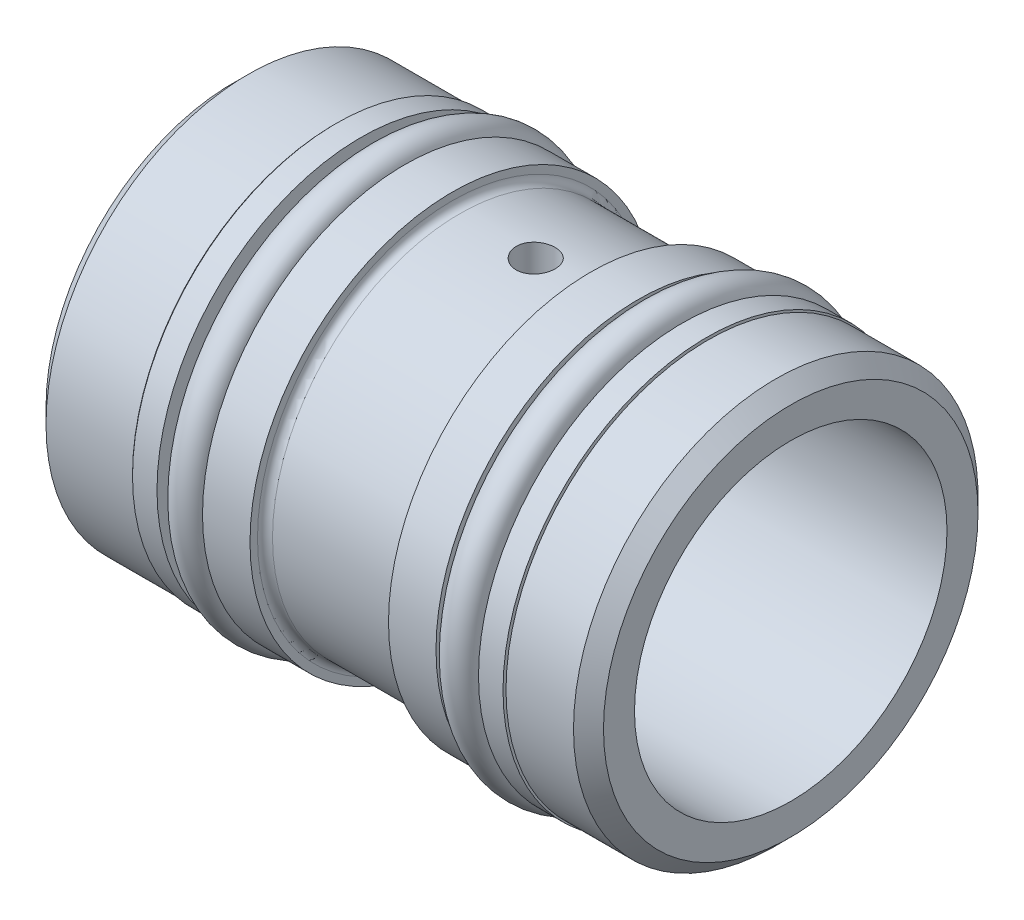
ISO-10303-21;
HEADER;
FILE_DESCRIPTION(('STEP AP214'),'2;1');
FILE_NAME('part.step','',(''),(''),'','','');
FILE_SCHEMA(('AUTOMOTIVE_DESIGN { 1 0 10303 214 1 1 1 1 }'));
ENDSEC;
DATA;
#1=APPLICATION_CONTEXT('core data for automotive mechanical design processes');
#2=APPLICATION_PROTOCOL_DEFINITION('international standard','automotive_design',2000,#1);
#3=PRODUCT_CONTEXT('',#1,'mechanical');
#4=PRODUCT('Part','Part','',(#3));
#5=PRODUCT_RELATED_PRODUCT_CATEGORY('part','',(#4));
#6=PRODUCT_DEFINITION_FORMATION('','',#4);
#7=PRODUCT_DEFINITION_CONTEXT('part definition',#1,'design');
#8=PRODUCT_DEFINITION('design','',#6,#7);
#9=PRODUCT_DEFINITION_SHAPE('','',#8);
#10=(LENGTH_UNIT() NAMED_UNIT(*) SI_UNIT(.MILLI.,.METRE.));
#11=(NAMED_UNIT(*) PLANE_ANGLE_UNIT() SI_UNIT($,.RADIAN.));
#12=(NAMED_UNIT(*) SI_UNIT($,.STERADIAN.) SOLID_ANGLE_UNIT());
#13=UNCERTAINTY_MEASURE_WITH_UNIT(LENGTH_MEASURE(1.E-05),#10,'distance_accuracy_value','');
#14=(GEOMETRIC_REPRESENTATION_CONTEXT(3) GLOBAL_UNCERTAINTY_ASSIGNED_CONTEXT((#13)) GLOBAL_UNIT_ASSIGNED_CONTEXT((#10,
#11,#12)) REPRESENTATION_CONTEXT('',''));
#15=CARTESIAN_POINT('',(0.,0.,0.));
#16=DIRECTION('',(0.,0.,1.));
#17=DIRECTION('',(1.,0.,0.));
#18=AXIS2_PLACEMENT_3D('',#15,#16,#17);
#19=CARTESIAN_POINT('',(0.,0.,0.));
#20=DIRECTION('',(-1.,0.,0.));
#21=DIRECTION('',(0.,0.,1.));
#22=AXIS2_PLACEMENT_3D('',#19,#20,#21);
#23=CYLINDRICAL_SURFACE('',#22,9.0043);
#24=CARTESIAN_POINT('',(7.73880715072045,0.,0.));
#25=DIRECTION('',(-1.,0.,0.));
#26=DIRECTION('',(0.,0.,1.));
#27=AXIS2_PLACEMENT_3D('',#24,#25,#26);
#28=CIRCLE('',#27,9.0043);
#29=CARTESIAN_POINT('',(7.73880715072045,0.,9.0043));
#30=VERTEX_POINT('',#29);
#31=EDGE_CURVE('E147',#30,#30,#28,.T.);
#32=ORIENTED_EDGE('',*,*,#31,.F.);
#33=EDGE_LOOP('',(#32));
#34=FACE_BOUND('',#33,.T.);
#35=CARTESIAN_POINT('',(8.6487,0.,0.));
#36=DIRECTION('',(1.,0.,0.));
#37=DIRECTION('',(0.,0.,-1.));
#38=AXIS2_PLACEMENT_3D('',#35,#36,#37);
#39=CIRCLE('',#38,9.0043);
#40=CARTESIAN_POINT('',(8.6487,0.,-9.0043));
#41=VERTEX_POINT('',#40);
#42=EDGE_CURVE('E10',#41,#41,#39,.T.);
#43=ORIENTED_EDGE('',*,*,#42,.F.);
#44=EDGE_LOOP('',(#43));
#45=FACE_BOUND('',#44,.T.);
#46=ADVANCED_FACE('F32',(#34,#45),#23,.T.);
#47=CARTESIAN_POINT('',(9.9695,0.,0.));
#48=DIRECTION('',(-1.,0.,0.));
#49=DIRECTION('',(0.,0.,1.));
#50=AXIS2_PLACEMENT_3D('',#47,#48,#49);
#51=CIRCLE('',#50,9.0043);
#52=CARTESIAN_POINT('',(9.9695,0.,9.0043));
#53=VERTEX_POINT('',#52);
#54=EDGE_CURVE('E199',#53,#53,#51,.T.);
#55=ORIENTED_EDGE('',*,*,#54,.T.);
#56=EDGE_LOOP('',(#55));
#57=FACE_BOUND('',#56,.T.);
#58=CARTESIAN_POINT('',(9.8933,0.,0.));
#59=DIRECTION('',(-1.,0.,0.));
#60=DIRECTION('',(0.,0.,1.));
#61=AXIS2_PLACEMENT_3D('',#58,#59,#60);
#62=CIRCLE('',#61,9.0043);
#63=CARTESIAN_POINT('',(9.8933,0.,9.0043));
#64=VERTEX_POINT('',#63);
#65=EDGE_CURVE('E44',#64,#64,#62,.T.);
#66=ORIENTED_EDGE('',*,*,#65,.F.);
#67=EDGE_LOOP('',(#66));
#68=FACE_BOUND('',#67,.T.);
#69=ADVANCED_FACE('F119',(#57,#68),#23,.T.);
#70=CARTESIAN_POINT('',(6.4135,0.,0.));
#71=DIRECTION('',(-1.,0.,0.));
#72=DIRECTION('',(0.,0.,1.));
#73=AXIS2_PLACEMENT_3D('',#70,#71,#72);
#74=CIRCLE('',#73,9.0043);
#75=CARTESIAN_POINT('',(6.4135,0.,9.0043));
#76=VERTEX_POINT('',#75);
#77=EDGE_CURVE('E143',#76,#76,#74,.T.);
#78=ORIENTED_EDGE('',*,*,#77,.F.);
#79=EDGE_LOOP('',(#78));
#80=FACE_BOUND('',#79,.T.);
#81=CARTESIAN_POINT('',(7.01859284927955,0.,0.));
#82=DIRECTION('',(1.,0.,0.));
#83=DIRECTION('',(0.,0.,-1.));
#84=AXIS2_PLACEMENT_3D('',#81,#82,#83);
#85=CIRCLE('',#84,9.0043);
#86=CARTESIAN_POINT('',(7.01859284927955,0.,-9.0043));
#87=VERTEX_POINT('',#86);
#88=EDGE_CURVE('E49',#87,#87,#85,.T.);
#89=ORIENTED_EDGE('',*,*,#88,.F.);
#90=EDGE_LOOP('',(#89));
#91=FACE_BOUND('',#90,.T.);
#92=ADVANCED_FACE('F122',(#80,#91),#23,.T.);
#93=CARTESIAN_POINT('',(0.,0.,0.));
#94=DIRECTION('',(-1.,0.,0.));
#95=DIRECTION('',(0.,0.,1.));
#96=AXIS2_PLACEMENT_3D('',#93,#94,#95);
#97=CYLINDRICAL_SURFACE('',#96,9.0043);
#98=CARTESIAN_POINT('',(-7.6835,0.,0.));
#99=DIRECTION('',(-1.,0.,0.));
#100=DIRECTION('',(0.,0.,1.));
#101=AXIS2_PLACEMENT_3D('',#98,#99,#100);
#102=CIRCLE('',#101,9.0043);
#103=CARTESIAN_POINT('',(-7.6835,0.,9.0043));
#104=VERTEX_POINT('',#103);
#105=EDGE_CURVE('E160',#104,#104,#102,.T.);
#106=ORIENTED_EDGE('',*,*,#105,.F.);
#107=EDGE_LOOP('',(#106));
#108=FACE_BOUND('',#107,.T.);
#109=CARTESIAN_POINT('',(-6.77360715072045,0.,0.));
#110=DIRECTION('',(1.,0.,0.));
#111=DIRECTION('',(0.,0.,-1.));
#112=AXIS2_PLACEMENT_3D('',#109,#110,#111);
#113=CIRCLE('',#112,9.0043);
#114=CARTESIAN_POINT('',(-6.77360715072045,0.,-9.0043));
#115=VERTEX_POINT('',#114);
#116=EDGE_CURVE('E149',#115,#115,#113,.T.);
#117=ORIENTED_EDGE('',*,*,#116,.F.);
#118=EDGE_LOOP('',(#117));
#119=FACE_BOUND('',#118,.T.);
#120=ADVANCED_FACE('F132',(#108,#119),#97,.T.);
#121=CARTESIAN_POINT('',(-5.4483,0.,0.));
#122=DIRECTION('',(-1.,0.,0.));
#123=DIRECTION('',(0.,0.,1.));
#124=AXIS2_PLACEMENT_3D('',#121,#122,#123);
#125=CIRCLE('',#124,9.0043);
#126=CARTESIAN_POINT('',(-5.4483,0.,9.0043));
#127=VERTEX_POINT('',#126);
#128=EDGE_CURVE('E215',#127,#127,#125,.T.);
#129=ORIENTED_EDGE('',*,*,#128,.T.);
#130=EDGE_LOOP('',(#129));
#131=FACE_BOUND('',#130,.T.);
#132=CARTESIAN_POINT('',(-6.05339284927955,0.,0.));
#133=DIRECTION('',(-1.,0.,0.));
#134=DIRECTION('',(0.,0.,1.));
#135=AXIS2_PLACEMENT_3D('',#132,#133,#134);
#136=CIRCLE('',#135,9.0043);
#137=CARTESIAN_POINT('',(-6.05339284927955,0.,9.0043));
#138=VERTEX_POINT('',#137);
#139=EDGE_CURVE('E154',#138,#138,#136,.T.);
#140=ORIENTED_EDGE('',*,*,#139,.F.);
#141=EDGE_LOOP('',(#140));
#142=FACE_BOUND('',#141,.T.);
#143=ADVANCED_FACE('F137',(#131,#142),#97,.T.);
#144=CARTESIAN_POINT('',(-9.0043,0.,0.));
#145=DIRECTION('',(-1.,0.,0.));
#146=DIRECTION('',(0.,0.,1.));
#147=AXIS2_PLACEMENT_3D('',#144,#145,#146);
#148=CIRCLE('',#147,9.0043);
#149=CARTESIAN_POINT('',(-9.0043,0.,9.0043));
#150=VERTEX_POINT('',#149);
#151=EDGE_CURVE('E218',#150,#150,#148,.T.);
#152=ORIENTED_EDGE('',*,*,#151,.F.);
#153=EDGE_LOOP('',(#152));
#154=FACE_BOUND('',#153,.T.);
#155=CARTESIAN_POINT('',(-8.9281,0.,0.));
#156=DIRECTION('',(1.,0.,0.));
#157=DIRECTION('',(0.,0.,-1.));
#158=AXIS2_PLACEMENT_3D('',#155,#156,#157);
#159=CIRCLE('',#158,9.0043);
#160=CARTESIAN_POINT('',(-8.9281,0.,-9.0043));
#161=VERTEX_POINT('',#160);
#162=EDGE_CURVE('E157',#161,#161,#159,.T.);
#163=ORIENTED_EDGE('',*,*,#162,.F.);
#164=EDGE_LOOP('',(#163));
#165=FACE_BOUND('',#164,.T.);
#166=ADVANCED_FACE('F98',(#154,#165),#97,.T.);
#167=CARTESIAN_POINT('',(0.,0.,0.));
#168=DIRECTION('',(-1.,0.,0.));
#169=DIRECTION('',(0.,0.,1.));
#170=AXIS2_PLACEMENT_3D('',#167,#168,#169);
#171=CYLINDRICAL_SURFACE('',#170,4.7625);
#172=CARTESIAN_POINT('',(0.0888999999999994,0.,0.));
#173=DIRECTION('',(-1.,0.,0.));
#174=DIRECTION('',(0.,0.,1.));
#175=AXIS2_PLACEMENT_3D('',#172,#173,#174);
#176=CIRCLE('',#175,4.7625);
#177=CARTESIAN_POINT('',(0.0888999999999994,0.,4.7625));
#178=VERTEX_POINT('',#177);
#179=EDGE_CURVE('E187',#178,#178,#176,.T.);
#180=ORIENTED_EDGE('',*,*,#179,.F.);
#181=EDGE_LOOP('',(#180));
#182=FACE_BOUND('',#181,.T.);
#183=CARTESIAN_POINT('',(-14.1605,0.,0.));
#184=DIRECTION('',(-1.,0.,0.));
#185=DIRECTION('',(0.,0.,1.));
#186=AXIS2_PLACEMENT_3D('',#183,#184,#185);
#187=CIRCLE('',#186,4.7625);
#188=CARTESIAN_POINT('',(-14.1605,0.,4.7625));
#189=VERTEX_POINT('',#188);
#190=EDGE_CURVE('E224',#189,#189,#187,.T.);
#191=ORIENTED_EDGE('',*,*,#190,.T.);
#192=EDGE_LOOP('',(#191));
#193=FACE_BOUND('',#192,.T.);
#194=ADVANCED_FACE('F94',(#182,#193),#171,.F.);
#195=CARTESIAN_POINT('',(0.0888999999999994,4.7625,0.));
#196=DIRECTION('',(-1.,0.,0.));
#197=DIRECTION('',(0.,0.,1.));
#198=AXIS2_PLACEMENT_3D('',#195,#196,#197);
#199=PLANE('',#198);
#200=CARTESIAN_POINT('',(0.0888999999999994,0.,0.));
#201=DIRECTION('',(-1.,0.,0.));
#202=DIRECTION('',(0.,0.,1.));
#203=AXIS2_PLACEMENT_3D('',#200,#201,#202);
#204=CIRCLE('',#203,7.9375);
#205=CARTESIAN_POINT('',(0.0888999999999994,0.,7.9375));
#206=VERTEX_POINT('',#205);
#207=EDGE_CURVE('E190',#206,#206,#204,.T.);
#208=ORIENTED_EDGE('',*,*,#207,.F.);
#209=EDGE_LOOP('',(#208));
#210=FACE_BOUND('',#209,.T.);
#211=ORIENTED_EDGE('',*,*,#179,.T.);
#212=EDGE_LOOP('',(#211));
#213=FACE_BOUND('',#212,.T.);
#214=ADVANCED_FACE('F88',(#210,#213),#199,.F.);
#215=CARTESIAN_POINT('',(0.,0.,0.));
#216=DIRECTION('',(-1.,0.,0.));
#217=DIRECTION('',(0.,0.,1.));
#218=AXIS2_PLACEMENT_3D('',#215,#216,#217);
#219=CYLINDRICAL_SURFACE('',#218,7.9375);
#220=CARTESIAN_POINT('',(1.2065,-7.8754439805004,0.9906));
#221=CARTESIAN_POINT('',(1.15109052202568,-7.87544477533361,0.990597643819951));
#222=CARTESIAN_POINT('',(1.09564639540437,-7.87603506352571,0.985935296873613));
#223=CARTESIAN_POINT('',(0.986301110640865,-7.87833154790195,0.967409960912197));
#224=CARTESIAN_POINT('',(0.932401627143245,-7.88003891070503,0.953537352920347));
#225=CARTESIAN_POINT('',(0.827744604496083,-7.88437321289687,0.917006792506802));
#226=CARTESIAN_POINT('',(0.776984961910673,-7.88699952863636,0.894354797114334));
#227=CARTESIAN_POINT('',(0.679996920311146,-7.892875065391,0.840921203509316));
#228=CARTESIAN_POINT('',(0.633767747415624,-7.89612417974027,0.810140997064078));
#229=CARTESIAN_POINT('',(0.546885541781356,-7.9028995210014,0.741140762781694));
#230=CARTESIAN_POINT('',(0.506261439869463,-7.90642704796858,0.702884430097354));
#231=CARTESIAN_POINT('',(0.431992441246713,-7.9133500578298,0.620096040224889));
#232=CARTESIAN_POINT('',(0.398347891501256,-7.91674553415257,0.575563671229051));
#233=CARTESIAN_POINT('',(0.338889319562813,-7.92303516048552,0.481305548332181));
#234=CARTESIAN_POINT('',(0.313101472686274,-7.92592762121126,0.431563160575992));
#235=CARTESIAN_POINT('',(0.270255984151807,-7.93087102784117,0.32841157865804));
#236=CARTESIAN_POINT('',(0.253198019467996,-7.93292200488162,0.275002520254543));
#237=CARTESIAN_POINT('',(0.22838292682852,-7.93594219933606,0.166329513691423));
#238=CARTESIAN_POINT('',(0.220577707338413,-7.93691700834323,0.111076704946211));
#239=CARTESIAN_POINT('',(0.214340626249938,-7.93769412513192,3.74751752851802E-05));
#240=CARTESIAN_POINT('',(0.215908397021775,-7.93749647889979,-0.0557489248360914));
#241=CARTESIAN_POINT('',(0.228334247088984,-7.93595547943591,-0.165944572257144));
#242=CARTESIAN_POINT('',(0.239140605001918,-7.9346185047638,-0.22035975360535));
#243=CARTESIAN_POINT('',(0.269656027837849,-7.93095624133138,-0.326598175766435));
#244=CARTESIAN_POINT('',(0.289365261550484,-7.92863093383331,-0.378421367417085));
#245=CARTESIAN_POINT('',(0.337181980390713,-7.9232423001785,-0.478164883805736));
#246=CARTESIAN_POINT('',(0.365311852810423,-7.9201770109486,-0.526074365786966));
#247=CARTESIAN_POINT('',(0.429155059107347,-7.9136513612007,-0.616512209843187));
#248=CARTESIAN_POINT('',(0.464868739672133,-7.91019098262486,-0.659040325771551));
#249=CARTESIAN_POINT('',(0.543155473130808,-7.9032345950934,-0.737812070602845));
#250=CARTESIAN_POINT('',(0.585773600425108,-7.89973850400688,-0.77401091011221));
#251=CARTESIAN_POINT('',(0.676504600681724,-7.89312799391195,-0.838748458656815));
#252=CARTESIAN_POINT('',(0.724617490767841,-7.89001357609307,-0.86728714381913));
#253=CARTESIAN_POINT('',(0.825012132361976,-7.88451906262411,-0.915896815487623));
#254=CARTESIAN_POINT('',(0.877295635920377,-7.88213927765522,-0.935964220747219));
#255=CARTESIAN_POINT('',(0.984526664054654,-7.87838953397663,-0.96702200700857));
#256=CARTESIAN_POINT('',(1.03947406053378,-7.87701952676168,-0.97801282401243));
#257=CARTESIAN_POINT('',(1.15007756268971,-7.87545331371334,-0.990546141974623));
#258=CARTESIAN_POINT('',(1.20572641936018,-7.87524927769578,-0.992151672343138));
#259=CARTESIAN_POINT('',(1.3164998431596,-7.8760173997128,-0.986035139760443));
#260=CARTESIAN_POINT('',(1.37162442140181,-7.8769895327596,-0.978313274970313));
#261=CARTESIAN_POINT('',(1.47959566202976,-7.87999331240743,-0.953814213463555));
#262=CARTESIAN_POINT('',(1.53244935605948,-7.88202138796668,-0.937067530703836));
#263=CARTESIAN_POINT('',(1.63459847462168,-7.88690564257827,-0.895025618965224));
#264=CARTESIAN_POINT('',(1.68389377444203,-7.88976185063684,-0.869730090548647));
#265=CARTESIAN_POINT('',(1.77781197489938,-7.89599930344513,-0.811153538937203));
#266=CARTESIAN_POINT('',(1.82240891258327,-7.89938323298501,-0.777831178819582));
#267=CARTESIAN_POINT('',(1.90539955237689,-7.90628640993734,-0.704205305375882));
#268=CARTESIAN_POINT('',(1.94379301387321,-7.909805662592,-0.663901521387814));
#269=CARTESIAN_POINT('',(2.01350822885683,-7.91660700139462,-0.577181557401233));
#270=CARTESIAN_POINT('',(2.04478856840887,-7.91988762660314,-0.53073195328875));
#271=CARTESIAN_POINT('',(2.0991030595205,-7.92582022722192,-0.433201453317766));
#272=CARTESIAN_POINT('',(2.12213737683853,-7.92847221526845,-0.382120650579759));
#273=CARTESIAN_POINT('',(2.1592375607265,-7.93284224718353,-0.276915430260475));
#274=CARTESIAN_POINT('',(2.17332737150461,-7.93456278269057,-0.222799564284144));
#275=CARTESIAN_POINT('',(2.19221647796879,-7.93688639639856,-0.112947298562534));
#276=CARTESIAN_POINT('',(2.19701619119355,-7.93748952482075,-0.0572109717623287));
#277=CARTESIAN_POINT('',(2.1971810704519,-7.93751013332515,0.0538956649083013));
#278=CARTESIAN_POINT('',(2.19261009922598,-7.93693563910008,0.109265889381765));
#279=CARTESIAN_POINT('',(2.17429860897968,-7.9346815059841,0.218444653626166));
#280=CARTESIAN_POINT('',(2.16055809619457,-7.93300186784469,0.272253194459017));
#281=CARTESIAN_POINT('',(2.12431759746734,-7.92872534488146,0.37677286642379));
#282=CARTESIAN_POINT('',(2.10182065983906,-7.92612877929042,0.427485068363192));
#283=CARTESIAN_POINT('',(2.04871253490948,-7.92030593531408,0.524424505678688));
#284=CARTESIAN_POINT('',(2.01810125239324,-7.91707964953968,0.570651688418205));
#285=CARTESIAN_POINT('',(1.94939707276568,-7.91033127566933,0.657635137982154));
#286=CARTESIAN_POINT('',(1.91125665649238,-7.90680739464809,0.69835373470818));
#287=CARTESIAN_POINT('',(1.82867551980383,-7.89987538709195,0.772837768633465));
#288=CARTESIAN_POINT('',(1.78423330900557,-7.89646728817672,0.806601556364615));
#289=CARTESIAN_POINT('',(1.69011401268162,-7.89013873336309,0.866328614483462));
#290=CARTESIAN_POINT('',(1.64041743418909,-7.88722020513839,0.892261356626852));
#291=CARTESIAN_POINT('',(1.53736614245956,-7.88222383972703,0.935376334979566));
#292=CARTESIAN_POINT('',(1.48401548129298,-7.88014508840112,0.95256809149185));
#293=CARTESIAN_POINT('',(1.39307375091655,-7.87756854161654,0.973595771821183));
#294=CARTESIAN_POINT('',(1.35605637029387,-7.87677579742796,0.979963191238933));
#295=CARTESIAN_POINT('',(1.2815312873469,-7.87571324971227,0.988466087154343));
#296=CARTESIAN_POINT('',(1.24402358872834,-7.87544344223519,0.990601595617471));
#297=CARTESIAN_POINT('',(1.2065,-7.8754439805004,0.9906));
#298=B_SPLINE_CURVE_WITH_KNOTS('',3,(#220,#221,#222,#223,#224,#225,#226,#227,#228,#229,#230,
#231,#232,#233,#234,#235,#236,#237,#238,#239,#240,#241,#242,#243,#244,#245,#246,#247,#248,#249,
#250,#251,#252,#253,#254,#255,#256,#257,#258,#259,#260,#261,#262,#263,#264,#265,#266,#267,#268,
#269,#270,#271,#272,#273,#274,#275,#276,#277,#278,#279,#280,#281,#282,#283,#284,#285,#286,#287,
#288,#289,#290,#291,#292,#293,#294,#295,#296,#297),.UNSPECIFIED.,.T.,.F.,(4,2,2,2,2,2,2,2,2,2,2,
2,2,2,2,2,2,2,2,2,2,2,2,2,2,2,2,2,2,2,2,2,2,2,2,2,2,2,4),(0.,0.166091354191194,
0.332356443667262,0.498508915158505,0.664632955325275,0.831584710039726,0.998544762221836,
1.16605512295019,1.33355928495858,1.50018896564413,1.66681211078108,1.83250849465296,
1.99820802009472,2.16435205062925,2.33050367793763,2.49778727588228,2.66507139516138,
2.83242616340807,2.9997728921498,3.16599445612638,3.3322124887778,3.49787201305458,
3.66353734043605,3.83007477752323,3.99661867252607,4.16410871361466,4.33159538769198,
4.49863179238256,4.66566068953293,4.83155504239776,4.99744928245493,5.16328582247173,
5.32912430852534,5.49604500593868,5.66300524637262,5.83060819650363,5.99802820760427,
6.11050699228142,6.22298492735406),.UNSPECIFIED.);
#299=CARTESIAN_POINT('',(1.2065,-7.8754439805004,0.9906));
#300=VERTEX_POINT('',#299);
#301=EDGE_CURVE('E78',#300,#300,#298,.T.);
#302=ORIENTED_EDGE('',*,*,#301,.T.);
#303=EDGE_LOOP('',(#302));
#304=FACE_BOUND('',#303,.T.);
#305=CARTESIAN_POINT('',(1.2065,7.8754439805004,0.9906));
#306=CARTESIAN_POINT('',(1.26190947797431,7.87544477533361,0.990597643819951));
#307=CARTESIAN_POINT('',(1.31735360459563,7.87603506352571,0.985935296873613));
#308=CARTESIAN_POINT('',(1.42669888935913,7.87833154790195,0.967409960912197));
#309=CARTESIAN_POINT('',(1.48059837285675,7.88003891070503,0.953537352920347));
#310=CARTESIAN_POINT('',(1.58525539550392,7.88437321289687,0.917006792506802));
#311=CARTESIAN_POINT('',(1.63601503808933,7.88699952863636,0.894354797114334));
#312=CARTESIAN_POINT('',(1.73300307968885,7.892875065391,0.840921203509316));
#313=CARTESIAN_POINT('',(1.77923225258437,7.89612417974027,0.810140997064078));
#314=CARTESIAN_POINT('',(1.86611445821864,7.9028995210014,0.741140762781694));
#315=CARTESIAN_POINT('',(1.90673856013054,7.90642704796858,0.702884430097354));
#316=CARTESIAN_POINT('',(1.98100755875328,7.9133500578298,0.620096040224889));
#317=CARTESIAN_POINT('',(2.01465210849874,7.91674553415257,0.575563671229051));
#318=CARTESIAN_POINT('',(2.07411068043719,7.92303516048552,0.481305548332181));
#319=CARTESIAN_POINT('',(2.09989852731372,7.92592762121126,0.431563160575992));
#320=CARTESIAN_POINT('',(2.14274401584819,7.93087102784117,0.32841157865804));
#321=CARTESIAN_POINT('',(2.159801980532,7.93292200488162,0.275002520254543));
#322=CARTESIAN_POINT('',(2.18461707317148,7.93594219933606,0.166329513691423));
#323=CARTESIAN_POINT('',(2.19242229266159,7.93691700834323,0.111076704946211));
#324=CARTESIAN_POINT('',(2.19865937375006,7.93769412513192,3.74751752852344E-05));
#325=CARTESIAN_POINT('',(2.19709160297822,7.93749647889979,-0.0557489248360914));
#326=CARTESIAN_POINT('',(2.18466575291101,7.93595547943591,-0.165944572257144));
#327=CARTESIAN_POINT('',(2.17385939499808,7.9346185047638,-0.22035975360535));
#328=CARTESIAN_POINT('',(2.14334397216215,7.93095624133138,-0.326598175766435));
#329=CARTESIAN_POINT('',(2.12363473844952,7.92863093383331,-0.378421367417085));
#330=CARTESIAN_POINT('',(2.07581801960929,7.9232423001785,-0.478164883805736));
#331=CARTESIAN_POINT('',(2.04768814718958,7.9201770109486,-0.526074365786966));
#332=CARTESIAN_POINT('',(1.98384494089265,7.9136513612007,-0.616512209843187));
#333=CARTESIAN_POINT('',(1.94813126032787,7.91019098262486,-0.659040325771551));
#334=CARTESIAN_POINT('',(1.86984452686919,7.9032345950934,-0.737812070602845));
#335=CARTESIAN_POINT('',(1.82722639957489,7.89973850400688,-0.77401091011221));
#336=CARTESIAN_POINT('',(1.73649539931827,7.89312799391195,-0.838748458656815));
#337=CARTESIAN_POINT('',(1.68838250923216,7.89001357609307,-0.86728714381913));
#338=CARTESIAN_POINT('',(1.58798786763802,7.88451906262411,-0.915896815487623));
#339=CARTESIAN_POINT('',(1.53570436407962,7.88213927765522,-0.935964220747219));
#340=CARTESIAN_POINT('',(1.42847333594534,7.87838953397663,-0.96702200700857));
#341=CARTESIAN_POINT('',(1.37352593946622,7.87701952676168,-0.97801282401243));
#342=CARTESIAN_POINT('',(1.26292243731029,7.87545331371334,-0.990546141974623));
#343=CARTESIAN_POINT('',(1.20727358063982,7.87524927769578,-0.992151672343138));
#344=CARTESIAN_POINT('',(1.0965001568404,7.8760173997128,-0.986035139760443));
#345=CARTESIAN_POINT('',(1.04137557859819,7.8769895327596,-0.978313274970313));
#346=CARTESIAN_POINT('',(0.933404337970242,7.87999331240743,-0.953814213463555));
#347=CARTESIAN_POINT('',(0.880550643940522,7.88202138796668,-0.937067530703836));
#348=CARTESIAN_POINT('',(0.778401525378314,7.88690564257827,-0.895025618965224));
#349=CARTESIAN_POINT('',(0.729106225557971,7.88976185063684,-0.869730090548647));
#350=CARTESIAN_POINT('',(0.635188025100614,7.89599930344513,-0.811153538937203));
#351=CARTESIAN_POINT('',(0.590591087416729,7.89938323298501,-0.777831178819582));
#352=CARTESIAN_POINT('',(0.507600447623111,7.90628640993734,-0.704205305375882));
#353=CARTESIAN_POINT('',(0.469206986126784,7.909805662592,-0.663901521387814));
#354=CARTESIAN_POINT('',(0.39949177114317,7.91660700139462,-0.577181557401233));
#355=CARTESIAN_POINT('',(0.368211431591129,7.91988762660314,-0.530731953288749));
#356=CARTESIAN_POINT('',(0.313896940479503,7.92582022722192,-0.433201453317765));
#357=CARTESIAN_POINT('',(0.290862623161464,7.92847221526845,-0.382120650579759));
#358=CARTESIAN_POINT('',(0.253762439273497,7.93284224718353,-0.276915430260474));
#359=CARTESIAN_POINT('',(0.239672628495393,7.93456278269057,-0.222799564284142));
#360=CARTESIAN_POINT('',(0.220783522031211,7.93688639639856,-0.112947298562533));
#361=CARTESIAN_POINT('',(0.215983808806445,7.93748952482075,-0.0572109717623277));
#362=CARTESIAN_POINT('',(0.215818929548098,7.93751013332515,0.0538956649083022));
#363=CARTESIAN_POINT('',(0.220389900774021,7.93693563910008,0.109265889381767));
#364=CARTESIAN_POINT('',(0.238701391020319,7.9346815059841,0.218444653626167));
#365=CARTESIAN_POINT('',(0.252441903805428,7.93300186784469,0.272253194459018));
#366=CARTESIAN_POINT('',(0.288682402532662,7.92872534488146,0.376772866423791));
#367=CARTESIAN_POINT('',(0.311179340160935,7.92612877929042,0.427485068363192));
#368=CARTESIAN_POINT('',(0.364287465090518,7.92030593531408,0.524424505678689));
#369=CARTESIAN_POINT('',(0.39489874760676,7.91707964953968,0.570651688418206));
#370=CARTESIAN_POINT('',(0.463602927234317,7.91033127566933,0.657635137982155));
#371=CARTESIAN_POINT('',(0.501743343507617,7.90680739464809,0.698353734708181));
#372=CARTESIAN_POINT('',(0.584324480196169,7.89987538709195,0.772837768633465));
#373=CARTESIAN_POINT('',(0.62876669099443,7.89646728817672,0.806601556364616));
#374=CARTESIAN_POINT('',(0.722885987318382,7.89013873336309,0.866328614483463));
#375=CARTESIAN_POINT('',(0.77258256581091,7.88722020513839,0.892261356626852));
#376=CARTESIAN_POINT('',(0.875633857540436,7.88222383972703,0.935376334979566));
#377=CARTESIAN_POINT('',(0.928984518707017,7.88014508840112,0.95256809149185));
#378=CARTESIAN_POINT('',(1.01992624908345,7.87756854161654,0.973595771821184));
#379=CARTESIAN_POINT('',(1.05694362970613,7.87677579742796,0.979963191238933));
#380=CARTESIAN_POINT('',(1.1314687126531,7.87571324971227,0.988466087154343));
#381=CARTESIAN_POINT('',(1.16897641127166,7.87544344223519,0.990601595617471));
#382=CARTESIAN_POINT('',(1.2065,7.8754439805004,0.9906));
#383=B_SPLINE_CURVE_WITH_KNOTS('',3,(#305,#306,#307,#308,#309,#310,#311,#312,#313,#314,#315,
#316,#317,#318,#319,#320,#321,#322,#323,#324,#325,#326,#327,#328,#329,#330,#331,#332,#333,#334,
#335,#336,#337,#338,#339,#340,#341,#342,#343,#344,#345,#346,#347,#348,#349,#350,#351,#352,#353,
#354,#355,#356,#357,#358,#359,#360,#361,#362,#363,#364,#365,#366,#367,#368,#369,#370,#371,#372,
#373,#374,#375,#376,#377,#378,#379,#380,#381,#382),.UNSPECIFIED.,.T.,.F.,(4,2,2,2,2,2,2,2,2,2,2,
2,2,2,2,2,2,2,2,2,2,2,2,2,2,2,2,2,2,2,2,2,2,2,2,2,2,2,4),(0.,0.166091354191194,
0.332356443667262,0.498508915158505,0.664632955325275,0.831584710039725,0.998544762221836,
1.16605512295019,1.33355928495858,1.50018896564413,1.66681211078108,1.83250849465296,
1.99820802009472,2.16435205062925,2.33050367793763,2.49778727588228,2.66507139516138,
2.83242616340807,2.99977289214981,3.16599445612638,3.33221248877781,3.49787201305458,
3.66353734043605,3.83007477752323,3.99661867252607,4.16410871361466,4.33159538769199,
4.49863179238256,4.66566068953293,4.83155504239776,4.99744928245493,5.16328582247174,
5.32912430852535,5.49604500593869,5.66300524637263,5.83060819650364,5.99802820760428,
6.11050699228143,6.22298492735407),.UNSPECIFIED.);
#384=CARTESIAN_POINT('',(1.2065,7.8754439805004,0.9906));
#385=VERTEX_POINT('',#384);
#386=EDGE_CURVE('E73',#385,#385,#383,.T.);
#387=ORIENTED_EDGE('',*,*,#386,.T.);
#388=EDGE_LOOP('',(#387));
#389=FACE_BOUND('',#388,.T.);
#390=CARTESIAN_POINT('',(14.1605,0.,0.));
#391=DIRECTION('',(-1.,0.,0.));
#392=DIRECTION('',(0.,0.,1.));
#393=AXIS2_PLACEMENT_3D('',#390,#391,#392);
#394=CIRCLE('',#393,7.9375);
#395=CARTESIAN_POINT('',(14.1605,0.,7.9375));
#396=VERTEX_POINT('',#395);
#397=EDGE_CURVE('E193',#396,#396,#394,.T.);
#398=ORIENTED_EDGE('',*,*,#397,.F.);
#399=EDGE_LOOP('',(#398));
#400=FACE_BOUND('',#399,.T.);
#401=ORIENTED_EDGE('',*,*,#207,.T.);
#402=EDGE_LOOP('',(#401));
#403=FACE_BOUND('',#402,.T.);
#404=ADVANCED_FACE('F82',(#304,#389,#400,#403),#219,.F.);
#405=CARTESIAN_POINT('',(14.1605,10.2743,0.));
#406=DIRECTION('',(-1.,0.,0.));
#407=DIRECTION('',(0.,0.,1.));
#408=AXIS2_PLACEMENT_3D('',#405,#406,#407);
#409=PLANE('',#408);
#410=CARTESIAN_POINT('',(14.1605,0.,0.));
#411=DIRECTION('',(-1.,0.,0.));
#412=DIRECTION('',(0.,0.,1.));
#413=AXIS2_PLACEMENT_3D('',#410,#411,#412);
#414=CIRCLE('',#413,9.51229999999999);
#415=CARTESIAN_POINT('',(14.1605,0.,9.51229999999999));
#416=VERTEX_POINT('',#415);
#417=EDGE_CURVE('E169',#416,#416,#414,.F.);
#418=ORIENTED_EDGE('',*,*,#417,.T.);
#419=EDGE_LOOP('',(#418));
#420=FACE_BOUND('',#419,.T.);
#421=ORIENTED_EDGE('',*,*,#397,.T.);
#422=EDGE_LOOP('',(#421));
#423=FACE_BOUND('',#422,.T.);
#424=ADVANCED_FACE('F87',(#420,#423),#409,.F.);
#425=CARTESIAN_POINT('',(0.,0.,0.));
#426=DIRECTION('',(-1.,0.,0.));
#427=DIRECTION('',(0.,0.,1.));
#428=AXIS2_PLACEMENT_3D('',#425,#426,#427);
#429=CYLINDRICAL_SURFACE('',#428,10.2743);
#430=CARTESIAN_POINT('',(13.3985,0.,0.));
#431=DIRECTION('',(-1.,0.,0.));
#432=DIRECTION('',(0.,0.,1.));
#433=AXIS2_PLACEMENT_3D('',#430,#431,#432);
#434=CIRCLE('',#433,10.2743);
#435=CARTESIAN_POINT('',(13.3985,0.,10.2743));
#436=VERTEX_POINT('',#435);
#437=EDGE_CURVE('E172',#436,#436,#434,.T.);
#438=ORIENTED_EDGE('',*,*,#437,.T.);
#439=EDGE_LOOP('',(#438));
#440=FACE_BOUND('',#439,.T.);
#441=CARTESIAN_POINT('',(9.9695,0.,0.));
#442=DIRECTION('',(-1.,0.,0.));
#443=DIRECTION('',(0.,0.,1.));
#444=AXIS2_PLACEMENT_3D('',#441,#442,#443);
#445=CIRCLE('',#444,10.2743);
#446=CARTESIAN_POINT('',(9.9695,0.,10.2743));
#447=VERTEX_POINT('',#446);
#448=EDGE_CURVE('E196',#447,#447,#445,.T.);
#449=ORIENTED_EDGE('',*,*,#448,.F.);
#450=EDGE_LOOP('',(#449));
#451=FACE_BOUND('',#450,.T.);
#452=ADVANCED_FACE('F419',(#440,#451),#429,.T.);
#453=CARTESIAN_POINT('',(9.9695,10.2743,0.));
#454=DIRECTION('',(1.,0.,0.));
#455=DIRECTION('',(0.,0.,-1.));
#456=AXIS2_PLACEMENT_3D('',#453,#454,#455);
#457=PLANE('',#456);
#458=ORIENTED_EDGE('',*,*,#54,.F.);
#459=EDGE_LOOP('',(#458));
#460=FACE_BOUND('',#459,.T.);
#461=ORIENTED_EDGE('',*,*,#448,.T.);
#462=EDGE_LOOP('',(#461));
#463=FACE_BOUND('',#462,.T.);
#464=ADVANCED_FACE('F427',(#460,#463),#457,.F.);
#465=CARTESIAN_POINT('',(6.4135,9.0043,0.));
#466=DIRECTION('',(-1.,0.,0.));
#467=DIRECTION('',(0.,0.,1.));
#468=AXIS2_PLACEMENT_3D('',#465,#466,#467);
#469=PLANE('',#468);
#470=CARTESIAN_POINT('',(6.4135,0.,0.));
#471=DIRECTION('',(-1.,0.,0.));
#472=DIRECTION('',(0.,0.,1.));
#473=AXIS2_PLACEMENT_3D('',#470,#471,#472);
#474=CIRCLE('',#473,10.2743);
#475=CARTESIAN_POINT('',(6.4135,0.,10.2743));
#476=VERTEX_POINT('',#475);
#477=EDGE_CURVE('E203',#476,#476,#474,.T.);
#478=ORIENTED_EDGE('',*,*,#477,.F.);
#479=EDGE_LOOP('',(#478));
#480=FACE_BOUND('',#479,.T.);
#481=ORIENTED_EDGE('',*,*,#77,.T.);
#482=EDGE_LOOP('',(#481));
#483=FACE_BOUND('',#482,.T.);
#484=ADVANCED_FACE('F434',(#480,#483),#469,.F.);
#485=CARTESIAN_POINT('',(0.,0.,0.));
#486=DIRECTION('',(-1.,0.,0.));
#487=DIRECTION('',(0.,0.,1.));
#488=AXIS2_PLACEMENT_3D('',#485,#486,#487);
#489=CYLINDRICAL_SURFACE('',#488,10.2743);
#490=CARTESIAN_POINT('',(4.0005,0.,0.));
#491=DIRECTION('',(-1.,0.,0.));
#492=DIRECTION('',(0.,0.,1.));
#493=AXIS2_PLACEMENT_3D('',#490,#491,#492);
#494=CIRCLE('',#493,10.2743);
#495=CARTESIAN_POINT('',(4.0005,0.,10.2743));
#496=VERTEX_POINT('',#495);
#497=EDGE_CURVE('E206',#496,#496,#494,.T.);
#498=ORIENTED_EDGE('',*,*,#497,.F.);
#499=EDGE_LOOP('',(#498));
#500=FACE_BOUND('',#499,.T.);
#501=ORIENTED_EDGE('',*,*,#477,.T.);
#502=EDGE_LOOP('',(#501));
#503=FACE_BOUND('',#502,.T.);
#504=ADVANCED_FACE('F294',(#500,#503),#489,.T.);
#505=CARTESIAN_POINT('',(4.0005,10.2743,0.));
#506=DIRECTION('',(1.,0.,0.));
#507=DIRECTION('',(0.,0.,-1.));
#508=AXIS2_PLACEMENT_3D('',#505,#506,#507);
#509=PLANE('',#508);
#510=CARTESIAN_POINT('',(4.0005,0.,0.));
#511=DIRECTION('',(1.,0.,0.));
#512=DIRECTION('',(0.,0.,-1.));
#513=AXIS2_PLACEMENT_3D('',#510,#511,#512);
#514=CIRCLE('',#513,9.8933);
#515=CARTESIAN_POINT('',(4.0005,0.,-9.8933));
#516=VERTEX_POINT('',#515);
#517=EDGE_CURVE('E178',#516,#516,#514,.T.);
#518=ORIENTED_EDGE('',*,*,#517,.T.);
#519=EDGE_LOOP('',(#518));
#520=FACE_BOUND('',#519,.T.);
#521=ORIENTED_EDGE('',*,*,#497,.T.);
#522=EDGE_LOOP('',(#521));
#523=FACE_BOUND('',#522,.T.);
#524=ADVANCED_FACE('F284',(#520,#523),#509,.F.);
#525=CARTESIAN_POINT('',(0.,0.,0.));
#526=DIRECTION('',(-1.,0.,0.));
#527=DIRECTION('',(0.,0.,1.));
#528=AXIS2_PLACEMENT_3D('',#525,#526,#527);
#529=CYLINDRICAL_SURFACE('',#528,9.5123);
#530=CARTESIAN_POINT('',(1.2065,-9.46057941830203,0.9906));
#531=CARTESIAN_POINT('',(1.26198033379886,-9.46058009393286,0.990597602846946));
#532=CARTESIAN_POINT('',(1.31749705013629,-9.46107271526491,0.985923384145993));
#533=CARTESIAN_POINT('',(1.42699038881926,-9.46298963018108,0.967348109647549));
#534=CARTESIAN_POINT('',(1.48096525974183,-9.46441494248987,0.953436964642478));
#535=CARTESIAN_POINT('',(1.58577347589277,-9.46803408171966,0.916798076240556));
#536=CARTESIAN_POINT('',(1.63660873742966,-9.47022743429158,0.894075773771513));
#537=CARTESIAN_POINT('',(1.7337332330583,-9.47513493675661,0.840470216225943));
#538=CARTESIAN_POINT('',(1.78002334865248,-9.47784898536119,0.809588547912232));
#539=CARTESIAN_POINT('',(1.86693625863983,-9.48350402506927,0.74041053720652));
#540=CARTESIAN_POINT('',(1.9075386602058,-9.4864457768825,0.702088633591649));
#541=CARTESIAN_POINT('',(1.98174789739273,-9.49221786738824,0.61917267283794));
#542=CARTESIAN_POINT('',(2.01535440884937,-9.4950482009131,0.57457832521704));
#543=CARTESIAN_POINT('',(2.07468885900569,-9.50028611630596,0.480257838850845));
#544=CARTESIAN_POINT('',(2.10039867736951,-9.50269272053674,0.430520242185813));
#545=CARTESIAN_POINT('',(2.14309399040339,-9.50680372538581,0.327404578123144));
#546=CARTESIAN_POINT('',(2.16007971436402,-9.508508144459,0.274026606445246));
#547=CARTESIAN_POINT('',(2.18478466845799,-9.51101739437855,0.165351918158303));
#548=CARTESIAN_POINT('',(2.19253746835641,-9.5118254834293,0.110062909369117));
#549=CARTESIAN_POINT('',(2.19866039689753,-9.51246211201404,-0.00103701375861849));
#550=CARTESIAN_POINT('',(2.19703078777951,-9.51229067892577,-0.0568479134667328));
#551=CARTESIAN_POINT('',(2.18446235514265,-9.51099024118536,-0.16717938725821));
#552=CARTESIAN_POINT('',(2.17355963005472,-9.50986494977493,-0.221704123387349));
#553=CARTESIAN_POINT('',(2.14281071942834,-9.50678750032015,-0.328145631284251));
#554=CARTESIAN_POINT('',(2.122964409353,-9.50483533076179,-0.380062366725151));
#555=CARTESIAN_POINT('',(2.07485229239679,-9.500317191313,-0.479927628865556));
#556=CARTESIAN_POINT('',(2.0465705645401,-9.4977500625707,-0.527868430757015));
#557=CARTESIAN_POINT('',(1.98240198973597,-9.49228993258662,-0.618336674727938));
#558=CARTESIAN_POINT('',(1.94651490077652,-9.48939692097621,-0.660863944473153));
#559=CARTESIAN_POINT('',(1.86795141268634,-9.4835933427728,-0.739509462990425));
#560=CARTESIAN_POINT('',(1.82524360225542,-9.48068275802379,-0.775596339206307));
#561=CARTESIAN_POINT('',(1.73435974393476,-9.47518575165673,-0.840093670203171));
#562=CARTESIAN_POINT('',(1.68618368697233,-9.47259933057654,-0.868504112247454));
#563=CARTESIAN_POINT('',(1.58570619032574,-9.46804330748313,-0.916842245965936));
#564=CARTESIAN_POINT('',(1.53340376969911,-9.4660738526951,-0.9367679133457));
#565=CARTESIAN_POINT('',(1.4261705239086,-9.4629777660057,-0.967545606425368));
#566=CARTESIAN_POINT('',(1.37123978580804,-9.46185110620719,-0.978397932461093));
#567=CARTESIAN_POINT('',(1.26058485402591,-9.46057304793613,-0.990680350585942));
#568=CARTESIAN_POINT('',(1.20486558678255,-9.46041710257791,-0.992154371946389));
#569=CARTESIAN_POINT('',(1.09397333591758,-9.46108612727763,-0.985753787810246));
#570=CARTESIAN_POINT('',(1.03880034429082,-9.4619110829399,-0.977879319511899));
#571=CARTESIAN_POINT('',(0.930695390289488,-9.46444481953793,-0.953042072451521));
#572=CARTESIAN_POINT('',(0.877758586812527,-9.46615157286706,-0.936100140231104));
#573=CARTESIAN_POINT('',(0.775478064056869,-9.47025495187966,-0.893630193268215));
#574=CARTESIAN_POINT('',(0.726134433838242,-9.4726515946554,-0.868101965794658));
#575=CARTESIAN_POINT('',(0.632240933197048,-9.47787570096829,-0.809074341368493));
#576=CARTESIAN_POINT('',(0.587709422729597,-9.48070472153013,-0.7755458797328));
#577=CARTESIAN_POINT('',(0.504890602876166,-9.48646976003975,-0.701511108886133));
#578=CARTESIAN_POINT('',(0.46660346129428,-9.48940578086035,-0.661004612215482));
#579=CARTESIAN_POINT('',(0.397208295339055,-9.49506776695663,-0.573972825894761));
#580=CARTESIAN_POINT('',(0.366128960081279,-9.49779286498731,-0.527424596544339));
#581=CARTESIAN_POINT('',(0.312229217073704,-9.50271328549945,-0.429743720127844));
#582=CARTESIAN_POINT('',(0.289408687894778,-9.50490861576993,-0.378611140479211));
#583=CARTESIAN_POINT('',(0.252722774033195,-9.5085182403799,-0.273312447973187));
#584=CARTESIAN_POINT('',(0.23884017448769,-9.50993403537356,-0.219152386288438));
#585=CARTESIAN_POINT('',(0.220368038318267,-9.5118312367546,-0.109254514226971));
#586=CARTESIAN_POINT('',(0.21577821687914,-9.51231267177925,-0.0535167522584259));
#587=CARTESIAN_POINT('',(0.216026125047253,-9.51228687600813,0.0576727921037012));
#588=CARTESIAN_POINT('',(0.220819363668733,-9.51178431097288,0.113124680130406));
#589=CARTESIAN_POINT('',(0.239603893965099,-9.50985619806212,0.222430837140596));
#590=CARTESIAN_POINT('',(0.253595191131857,-9.50843064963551,0.276285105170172));
#591=CARTESIAN_POINT('',(0.290366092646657,-9.50481624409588,0.380866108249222));
#592=CARTESIAN_POINT('',(0.313144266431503,-9.50262751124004,0.431593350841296));
#593=CARTESIAN_POINT('',(0.366837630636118,-9.49773047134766,0.52851169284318));
#594=CARTESIAN_POINT('',(0.397752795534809,-9.49502216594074,0.574702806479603));
#595=CARTESIAN_POINT('',(0.467009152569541,-9.48937386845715,0.661465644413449));
#596=CARTESIAN_POINT('',(0.505383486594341,-9.48643287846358,0.702010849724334));
#597=CARTESIAN_POINT('',(0.588402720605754,-9.48065906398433,0.776105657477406));
#598=CARTESIAN_POINT('',(0.633049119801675,-9.47782626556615,0.809653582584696));
#599=CARTESIAN_POINT('',(0.727480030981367,-9.4725812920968,0.868875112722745));
#600=CARTESIAN_POINT('',(0.777278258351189,-9.47017028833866,0.894526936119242));
#601=CARTESIAN_POINT('',(0.880469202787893,-9.46605579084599,0.937069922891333));
#602=CARTESIAN_POINT('',(0.933857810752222,-9.46435150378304,0.953970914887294));
#603=CARTESIAN_POINT('',(1.02403749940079,-9.46227082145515,0.974342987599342));
#604=CARTESIAN_POINT('',(1.0602531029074,-9.46163956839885,0.980430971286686));
#605=CARTESIAN_POINT('',(1.13314050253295,-9.46079364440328,0.988560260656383));
#606=CARTESIAN_POINT('',(1.16981229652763,-9.46057897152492,0.990601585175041));
#607=CARTESIAN_POINT('',(1.2065,-9.46057941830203,0.9906));
#608=B_SPLINE_CURVE_WITH_KNOTS('',3,(#530,#531,#532,#533,#534,#535,#536,#537,#538,#539,#540,
#541,#542,#543,#544,#545,#546,#547,#548,#549,#550,#551,#552,#553,#554,#555,#556,#557,#558,#559,
#560,#561,#562,#563,#564,#565,#566,#567,#568,#569,#570,#571,#572,#573,#574,#575,#576,#577,#578,
#579,#580,#581,#582,#583,#584,#585,#586,#587,#588,#589,#590,#591,#592,#593,#594,#595,#596,#597,
#598,#599,#600,#601,#602,#603,#604,#605,#606,#607),.UNSPECIFIED.,.T.,.F.,(4,2,2,2,2,2,2,2,2,2,2,
2,2,2,2,2,2,2,2,2,2,2,2,2,2,2,2,2,2,2,2,2,2,2,2,2,2,2,4),(0.,0.166307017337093,
0.332795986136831,0.499182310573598,0.665536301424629,0.832472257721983,0.99941594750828,
1.16673990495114,1.33405946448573,1.50076879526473,1.66747346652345,1.83353214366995,
1.99959313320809,2.16596955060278,2.3323512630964,2.49952256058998,2.66669413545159,
2.8339055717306,3.0011114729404,3.16753357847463,3.33395324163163,3.4999919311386,
3.66603473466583,3.83269020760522,3.99935015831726,4.16666249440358,4.33397237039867,
4.50095902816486,4.66794056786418,4.83413226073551,5.0003240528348,5.16648879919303,
5.33265302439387,5.49957314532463,5.6665332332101,5.83394984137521,6.00117800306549,
6.11115302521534,6.22112753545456),.UNSPECIFIED.);
#609=CARTESIAN_POINT('',(1.2065,-9.46057941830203,0.9906));
#610=VERTEX_POINT('',#609);
#611=EDGE_CURVE('E36',#610,#610,#608,.T.);
#612=ORIENTED_EDGE('',*,*,#611,.T.);
#613=EDGE_LOOP('',(#612));
#614=FACE_BOUND('',#613,.T.);
#615=CARTESIAN_POINT('',(1.2065,9.46057941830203,0.9906));
#616=CARTESIAN_POINT('',(1.15101966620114,9.46058009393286,0.990597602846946));
#617=CARTESIAN_POINT('',(1.09550294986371,9.46107271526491,0.985923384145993));
#618=CARTESIAN_POINT('',(0.986009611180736,9.46298963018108,0.967348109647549));
#619=CARTESIAN_POINT('',(0.93203474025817,9.46441494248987,0.953436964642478));
#620=CARTESIAN_POINT('',(0.827226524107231,9.46803408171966,0.916798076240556));
#621=CARTESIAN_POINT('',(0.776391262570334,9.47022743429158,0.894075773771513));
#622=CARTESIAN_POINT('',(0.679266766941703,9.47513493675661,0.840470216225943));
#623=CARTESIAN_POINT('',(0.632976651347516,9.47784898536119,0.809588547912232));
#624=CARTESIAN_POINT('',(0.546063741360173,9.48350402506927,0.74041053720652));
#625=CARTESIAN_POINT('',(0.505461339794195,9.4864457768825,0.702088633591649));
#626=CARTESIAN_POINT('',(0.43125210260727,9.49221786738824,0.61917267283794));
#627=CARTESIAN_POINT('',(0.397645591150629,9.4950482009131,0.574578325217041));
#628=CARTESIAN_POINT('',(0.33831114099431,9.50028611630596,0.480257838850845));
#629=CARTESIAN_POINT('',(0.312601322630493,9.50269272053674,0.430520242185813));
#630=CARTESIAN_POINT('',(0.269906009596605,9.50680372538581,0.327404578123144));
#631=CARTESIAN_POINT('',(0.252920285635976,9.508508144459,0.274026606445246));
#632=CARTESIAN_POINT('',(0.228215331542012,9.51101739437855,0.165351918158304));
#633=CARTESIAN_POINT('',(0.220462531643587,9.5118254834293,0.110062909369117));
#634=CARTESIAN_POINT('',(0.214339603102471,9.51246211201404,-0.0010370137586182));
#635=CARTESIAN_POINT('',(0.215969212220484,9.51229067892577,-0.0568479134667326));
#636=CARTESIAN_POINT('',(0.228537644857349,9.51099024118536,-0.16717938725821));
#637=CARTESIAN_POINT('',(0.23944036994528,9.50986494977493,-0.221704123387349));
#638=CARTESIAN_POINT('',(0.270189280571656,9.50678750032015,-0.328145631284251));
#639=CARTESIAN_POINT('',(0.290035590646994,9.50483533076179,-0.380062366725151));
#640=CARTESIAN_POINT('',(0.338147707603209,9.500317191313,-0.479927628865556));
#641=CARTESIAN_POINT('',(0.366429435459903,9.4977500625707,-0.527868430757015));
#642=CARTESIAN_POINT('',(0.430598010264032,9.49228993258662,-0.618336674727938));
#643=CARTESIAN_POINT('',(0.466485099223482,9.48939692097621,-0.660863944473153));
#644=CARTESIAN_POINT('',(0.545048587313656,9.4835933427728,-0.739509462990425));
#645=CARTESIAN_POINT('',(0.587756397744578,9.48068275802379,-0.775596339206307));
#646=CARTESIAN_POINT('',(0.678640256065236,9.47518575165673,-0.840093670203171));
#647=CARTESIAN_POINT('',(0.726816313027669,9.47259933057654,-0.868504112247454));
#648=CARTESIAN_POINT('',(0.827293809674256,9.46804330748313,-0.916842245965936));
#649=CARTESIAN_POINT('',(0.879596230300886,9.4660738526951,-0.9367679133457));
#650=CARTESIAN_POINT('',(0.986829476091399,9.4629777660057,-0.967545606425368));
#651=CARTESIAN_POINT('',(1.04176021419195,9.46185110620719,-0.978397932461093));
#652=CARTESIAN_POINT('',(1.15241514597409,9.46057304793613,-0.990680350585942));
#653=CARTESIAN_POINT('',(1.20813441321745,9.46041710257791,-0.992154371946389));
#654=CARTESIAN_POINT('',(1.31902666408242,9.46108612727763,-0.985753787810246));
#655=CARTESIAN_POINT('',(1.37419965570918,9.4619110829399,-0.977879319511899));
#656=CARTESIAN_POINT('',(1.48230460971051,9.46444481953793,-0.953042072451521));
#657=CARTESIAN_POINT('',(1.53524141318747,9.46615157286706,-0.936100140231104));
#658=CARTESIAN_POINT('',(1.63752193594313,9.47025495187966,-0.893630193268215));
#659=CARTESIAN_POINT('',(1.68686556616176,9.4726515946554,-0.868101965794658));
#660=CARTESIAN_POINT('',(1.78075906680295,9.47787570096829,-0.809074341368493));
#661=CARTESIAN_POINT('',(1.8252905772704,9.48070472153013,-0.775545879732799));
#662=CARTESIAN_POINT('',(1.90810939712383,9.48646976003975,-0.701511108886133));
#663=CARTESIAN_POINT('',(1.94639653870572,9.48940578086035,-0.661004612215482));
#664=CARTESIAN_POINT('',(2.01579170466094,9.49506776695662,-0.573972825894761));
#665=CARTESIAN_POINT('',(2.04687103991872,9.49779286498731,-0.527424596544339));
#666=CARTESIAN_POINT('',(2.10077078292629,9.50271328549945,-0.429743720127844));
#667=CARTESIAN_POINT('',(2.12359131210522,9.50490861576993,-0.378611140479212));
#668=CARTESIAN_POINT('',(2.1602772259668,9.5085182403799,-0.273312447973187));
#669=CARTESIAN_POINT('',(2.17415982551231,9.50993403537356,-0.219152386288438));
#670=CARTESIAN_POINT('',(2.19263196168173,9.5118312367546,-0.109254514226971));
#671=CARTESIAN_POINT('',(2.19722178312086,9.51231267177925,-0.0535167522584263));
#672=CARTESIAN_POINT('',(2.19697387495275,9.51228687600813,0.0576727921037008));
#673=CARTESIAN_POINT('',(2.19218063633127,9.51178431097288,0.113124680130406));
#674=CARTESIAN_POINT('',(2.1733961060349,9.50985619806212,0.222430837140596));
#675=CARTESIAN_POINT('',(2.15940480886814,9.50843064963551,0.276285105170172));
#676=CARTESIAN_POINT('',(2.12263390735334,9.50481624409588,0.380866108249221));
#677=CARTESIAN_POINT('',(2.0998557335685,9.50262751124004,0.431593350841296));
#678=CARTESIAN_POINT('',(2.04616236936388,9.49773047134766,0.528511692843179));
#679=CARTESIAN_POINT('',(2.01524720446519,9.49502216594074,0.574702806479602));
#680=CARTESIAN_POINT('',(1.94599084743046,9.48937386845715,0.661465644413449));
#681=CARTESIAN_POINT('',(1.90761651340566,9.48643287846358,0.702010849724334));
#682=CARTESIAN_POINT('',(1.82459727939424,9.48065906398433,0.776105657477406));
#683=CARTESIAN_POINT('',(1.77995088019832,9.47782626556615,0.809653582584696));
#684=CARTESIAN_POINT('',(1.68551996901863,9.4725812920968,0.868875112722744));
#685=CARTESIAN_POINT('',(1.63572174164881,9.47017028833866,0.894526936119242));
#686=CARTESIAN_POINT('',(1.53253079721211,9.46605579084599,0.937069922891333));
#687=CARTESIAN_POINT('',(1.47914218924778,9.46435150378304,0.953970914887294));
#688=CARTESIAN_POINT('',(1.38896250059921,9.46227082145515,0.974342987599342));
#689=CARTESIAN_POINT('',(1.3527468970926,9.46163956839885,0.980430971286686));
#690=CARTESIAN_POINT('',(1.27985949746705,9.46079364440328,0.988560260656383));
#691=CARTESIAN_POINT('',(1.24318770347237,9.46057897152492,0.990601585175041));
#692=CARTESIAN_POINT('',(1.2065,9.46057941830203,0.9906));
#693=B_SPLINE_CURVE_WITH_KNOTS('',3,(#615,#616,#617,#618,#619,#620,#621,#622,#623,#624,#625,
#626,#627,#628,#629,#630,#631,#632,#633,#634,#635,#636,#637,#638,#639,#640,#641,#642,#643,#644,
#645,#646,#647,#648,#649,#650,#651,#652,#653,#654,#655,#656,#657,#658,#659,#660,#661,#662,#663,
#664,#665,#666,#667,#668,#669,#670,#671,#672,#673,#674,#675,#676,#677,#678,#679,#680,#681,#682,
#683,#684,#685,#686,#687,#688,#689,#690,#691,#692),.UNSPECIFIED.,.T.,.F.,(4,2,2,2,2,2,2,2,2,2,2,
2,2,2,2,2,2,2,2,2,2,2,2,2,2,2,2,2,2,2,2,2,2,2,2,2,2,2,4),(0.,0.166307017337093,
0.332795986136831,0.499182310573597,0.665536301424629,0.832472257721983,0.99941594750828,
1.16673990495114,1.33405946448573,1.50076879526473,1.66747346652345,1.83353214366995,
1.99959313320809,2.16596955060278,2.3323512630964,2.49952256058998,2.66669413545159,
2.8339055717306,3.0011114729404,3.16753357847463,3.33395324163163,3.4999919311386,
3.66603473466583,3.83269020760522,3.99935015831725,4.16666249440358,4.33397237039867,
4.50095902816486,4.66794056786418,4.83413226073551,5.0003240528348,5.16648879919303,
5.33265302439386,5.49957314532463,5.6665332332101,5.83394984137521,6.00117800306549,
6.11115302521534,6.22112753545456),.UNSPECIFIED.);
#694=CARTESIAN_POINT('',(1.2065,9.46057941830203,0.9906));
#695=VERTEX_POINT('',#694);
#696=EDGE_CURVE('E52',#695,#695,#693,.T.);
#697=ORIENTED_EDGE('',*,*,#696,.T.);
#698=EDGE_LOOP('',(#697));
#699=FACE_BOUND('',#698,.T.);
#700=CARTESIAN_POINT('',(3.6195,0.,0.));
#701=DIRECTION('',(1.,0.,0.));
#702=DIRECTION('',(0.,0.,-1.));
#703=AXIS2_PLACEMENT_3D('',#700,#701,#702);
#704=CIRCLE('',#703,9.5123);
#705=CARTESIAN_POINT('',(3.6195,0.,-9.5123));
#706=VERTEX_POINT('',#705);
#707=EDGE_CURVE('E181',#706,#706,#704,.F.);
#708=ORIENTED_EDGE('',*,*,#707,.T.);
#709=EDGE_LOOP('',(#708));
#710=FACE_BOUND('',#709,.T.);
#711=CARTESIAN_POINT('',(-2.6543,0.,0.));
#712=DIRECTION('',(-1.,0.,0.));
#713=DIRECTION('',(0.,0.,1.));
#714=AXIS2_PLACEMENT_3D('',#711,#712,#713);
#715=CIRCLE('',#714,9.5123);
#716=CARTESIAN_POINT('',(-2.6543,0.,9.5123));
#717=VERTEX_POINT('',#716);
#718=EDGE_CURVE('E184',#717,#717,#715,.F.);
#719=ORIENTED_EDGE('',*,*,#718,.T.);
#720=EDGE_LOOP('',(#719));
#721=FACE_BOUND('',#720,.T.);
#722=ADVANCED_FACE('F56',(#614,#699,#710,#721),#529,.T.);
#723=CARTESIAN_POINT('',(-3.0353,10.2743,0.));
#724=DIRECTION('',(-1.,0.,0.));
#725=DIRECTION('',(0.,0.,1.));
#726=AXIS2_PLACEMENT_3D('',#723,#724,#725);
#727=PLANE('',#726);
#728=CARTESIAN_POINT('',(-3.0353,0.,0.));
#729=DIRECTION('',(-1.,0.,0.));
#730=DIRECTION('',(0.,0.,1.));
#731=AXIS2_PLACEMENT_3D('',#728,#729,#730);
#732=CIRCLE('',#731,9.8933);
#733=CARTESIAN_POINT('',(-3.0353,0.,9.8933));
#734=VERTEX_POINT('',#733);
#735=EDGE_CURVE('E175',#734,#734,#732,.T.);
#736=ORIENTED_EDGE('',*,*,#735,.T.);
#737=EDGE_LOOP('',(#736));
#738=FACE_BOUND('',#737,.T.);
#739=CARTESIAN_POINT('',(-3.0353,0.,0.));
#740=DIRECTION('',(-1.,0.,0.));
#741=DIRECTION('',(0.,0.,1.));
#742=AXIS2_PLACEMENT_3D('',#739,#740,#741);
#743=CIRCLE('',#742,10.2743);
#744=CARTESIAN_POINT('',(-3.0353,0.,10.2743));
#745=VERTEX_POINT('',#744);
#746=EDGE_CURVE('E209',#745,#745,#743,.T.);
#747=ORIENTED_EDGE('',*,*,#746,.F.);
#748=EDGE_LOOP('',(#747));
#749=FACE_BOUND('',#748,.T.);
#750=ADVANCED_FACE('F277',(#738,#749),#727,.F.);
#751=CARTESIAN_POINT('',(0.,0.,0.));
#752=DIRECTION('',(-1.,0.,0.));
#753=DIRECTION('',(0.,0.,1.));
#754=AXIS2_PLACEMENT_3D('',#751,#752,#753);
#755=CYLINDRICAL_SURFACE('',#754,10.2743);
#756=CARTESIAN_POINT('',(-5.4483,0.,0.));
#757=DIRECTION('',(-1.,0.,0.));
#758=DIRECTION('',(0.,0.,1.));
#759=AXIS2_PLACEMENT_3D('',#756,#757,#758);
#760=CIRCLE('',#759,10.2743);
#761=CARTESIAN_POINT('',(-5.4483,0.,10.2743));
#762=VERTEX_POINT('',#761);
#763=EDGE_CURVE('E212',#762,#762,#760,.T.);
#764=ORIENTED_EDGE('',*,*,#763,.F.);
#765=EDGE_LOOP('',(#764));
#766=FACE_BOUND('',#765,.T.);
#767=ORIENTED_EDGE('',*,*,#746,.T.);
#768=EDGE_LOOP('',(#767));
#769=FACE_BOUND('',#768,.T.);
#770=ADVANCED_FACE('F274',(#766,#769),#755,.T.);
#771=CARTESIAN_POINT('',(-5.4483,9.0043,0.));
#772=DIRECTION('',(1.,0.,0.));
#773=DIRECTION('',(0.,0.,-1.));
#774=AXIS2_PLACEMENT_3D('',#771,#772,#773);
#775=PLANE('',#774);
#776=ORIENTED_EDGE('',*,*,#128,.F.);
#777=EDGE_LOOP('',(#776));
#778=FACE_BOUND('',#777,.T.);
#779=ORIENTED_EDGE('',*,*,#763,.T.);
#780=EDGE_LOOP('',(#779));
#781=FACE_BOUND('',#780,.T.);
#782=ADVANCED_FACE('F267',(#778,#781),#775,.F.);
#783=CARTESIAN_POINT('',(-9.0043,10.2743,0.));
#784=DIRECTION('',(-1.,0.,0.));
#785=DIRECTION('',(0.,0.,1.));
#786=AXIS2_PLACEMENT_3D('',#783,#784,#785);
#787=PLANE('',#786);
#788=CARTESIAN_POINT('',(-9.0043,0.,0.));
#789=DIRECTION('',(-1.,0.,0.));
#790=DIRECTION('',(0.,0.,1.));
#791=AXIS2_PLACEMENT_3D('',#788,#789,#790);
#792=CIRCLE('',#791,10.2743);
#793=CARTESIAN_POINT('',(-9.0043,0.,10.2743));
#794=VERTEX_POINT('',#793);
#795=EDGE_CURVE('E221',#794,#794,#792,.T.);
#796=ORIENTED_EDGE('',*,*,#795,.F.);
#797=EDGE_LOOP('',(#796));
#798=FACE_BOUND('',#797,.T.);
#799=ORIENTED_EDGE('',*,*,#151,.T.);
#800=EDGE_LOOP('',(#799));
#801=FACE_BOUND('',#800,.T.);
#802=ADVANCED_FACE('F260',(#798,#801),#787,.F.);
#803=CARTESIAN_POINT('',(0.,0.,0.));
#804=DIRECTION('',(-1.,0.,0.));
#805=DIRECTION('',(0.,0.,1.));
#806=AXIS2_PLACEMENT_3D('',#803,#804,#805);
#807=CYLINDRICAL_SURFACE('',#806,10.2743);
#808=CARTESIAN_POINT('',(-13.3985,0.,0.));
#809=DIRECTION('',(1.,0.,0.));
#810=DIRECTION('',(0.,0.,-1.));
#811=AXIS2_PLACEMENT_3D('',#808,#809,#810);
#812=CIRCLE('',#811,10.2743);
#813=CARTESIAN_POINT('',(-13.3985,0.,-10.2743));
#814=VERTEX_POINT('',#813);
#815=EDGE_CURVE('E163',#814,#814,#812,.T.);
#816=ORIENTED_EDGE('',*,*,#815,.T.);
#817=EDGE_LOOP('',(#816));
#818=FACE_BOUND('',#817,.T.);
#819=ORIENTED_EDGE('',*,*,#795,.T.);
#820=EDGE_LOOP('',(#819));
#821=FACE_BOUND('',#820,.T.);
#822=ADVANCED_FACE('F254',(#818,#821),#807,.T.);
#823=CARTESIAN_POINT('',(-14.1605,4.7625,0.));
#824=DIRECTION('',(1.,0.,0.));
#825=DIRECTION('',(0.,0.,-1.));
#826=AXIS2_PLACEMENT_3D('',#823,#824,#825);
#827=PLANE('',#826);
#828=CARTESIAN_POINT('',(-14.1605,0.,0.));
#829=DIRECTION('',(1.,0.,0.));
#830=DIRECTION('',(0.,0.,-1.));
#831=AXIS2_PLACEMENT_3D('',#828,#829,#830);
#832=CIRCLE('',#831,9.51230000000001);
#833=CARTESIAN_POINT('',(-14.1605,0.,-9.51230000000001));
#834=VERTEX_POINT('',#833);
#835=EDGE_CURVE('E166',#834,#834,#832,.F.);
#836=ORIENTED_EDGE('',*,*,#835,.T.);
#837=EDGE_LOOP('',(#836));
#838=FACE_BOUND('',#837,.T.);
#839=ORIENTED_EDGE('',*,*,#190,.F.);
#840=EDGE_LOOP('',(#839));
#841=FACE_BOUND('',#840,.T.);
#842=ADVANCED_FACE('F104',(#838,#841),#827,.F.);
#843=CARTESIAN_POINT('',(3.6195,0.,0.));
#844=DIRECTION('',(1.,0.,0.));
#845=DIRECTION('',(0.,0.,-1.));
#846=AXIS2_PLACEMENT_3D('',#843,#844,#845);
#847=TOROIDAL_SURFACE('',#846,9.8933,0.381);
#848=ORIENTED_EDGE('',*,*,#517,.F.);
#849=EDGE_LOOP('',(#848));
#850=FACE_BOUND('',#849,.T.);
#851=ORIENTED_EDGE('',*,*,#707,.F.);
#852=EDGE_LOOP('',(#851));
#853=FACE_BOUND('',#852,.T.);
#854=ADVANCED_FACE('F100',(#850,#853),#847,.F.);
#855=CARTESIAN_POINT('',(-2.6543,0.,0.));
#856=DIRECTION('',(-1.,0.,0.));
#857=DIRECTION('',(0.,0.,1.));
#858=AXIS2_PLACEMENT_3D('',#855,#856,#857);
#859=TOROIDAL_SURFACE('',#858,9.8933,0.381);
#860=ORIENTED_EDGE('',*,*,#718,.F.);
#861=EDGE_LOOP('',(#860));
#862=FACE_BOUND('',#861,.T.);
#863=ORIENTED_EDGE('',*,*,#735,.F.);
#864=EDGE_LOOP('',(#863));
#865=FACE_BOUND('',#864,.T.);
#866=ADVANCED_FACE('F103',(#862,#865),#859,.F.);
#867=CARTESIAN_POINT('',(13.3985,0.,0.));
#868=DIRECTION('',(-1.,0.,0.));
#869=DIRECTION('',(0.,0.,1.));
#870=AXIS2_PLACEMENT_3D('',#867,#868,#869);
#871=CONICAL_SURFACE('',#870,10.2743,0.785398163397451);
#872=ORIENTED_EDGE('',*,*,#417,.F.);
#873=EDGE_LOOP('',(#872));
#874=FACE_BOUND('',#873,.T.);
#875=ORIENTED_EDGE('',*,*,#437,.F.);
#876=EDGE_LOOP('',(#875));
#877=FACE_BOUND('',#876,.T.);
#878=ADVANCED_FACE('F107',(#874,#877),#871,.T.);
#879=CARTESIAN_POINT('',(-14.1605,0.,0.));
#880=DIRECTION('',(1.,0.,0.));
#881=DIRECTION('',(0.,0.,-1.));
#882=AXIS2_PLACEMENT_3D('',#879,#880,#881);
#883=CONICAL_SURFACE('',#882,9.51230000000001,0.785398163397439);
#884=ORIENTED_EDGE('',*,*,#815,.F.);
#885=EDGE_LOOP('',(#884));
#886=FACE_BOUND('',#885,.T.);
#887=ORIENTED_EDGE('',*,*,#835,.F.);
#888=EDGE_LOOP('',(#887));
#889=FACE_BOUND('',#888,.T.);
#890=ADVANCED_FACE('F34',(#886,#889),#883,.T.);
#891=CARTESIAN_POINT('',(-8.9281,9.0043,0.));
#892=DIRECTION('',(1.,0.,0.));
#893=DIRECTION('',(0.,0.,-1.));
#894=AXIS2_PLACEMENT_3D('',#891,#892,#893);
#895=PLANE('',#894);
#896=ORIENTED_EDGE('',*,*,#162,.T.);
#897=EDGE_LOOP('',(#896));
#898=FACE_BOUND('',#897,.T.);
#899=CARTESIAN_POINT('',(-8.9281,0.,0.));
#900=DIRECTION('',(-1.,0.,0.));
#901=DIRECTION('',(0.,0.,1.));
#902=AXIS2_PLACEMENT_3D('',#899,#900,#901);
#903=CIRCLE('',#902,10.3505);
#904=CARTESIAN_POINT('',(-8.9281,0.,10.3505));
#905=VERTEX_POINT('',#904);
#906=EDGE_CURVE('E227',#905,#905,#903,.T.);
#907=ORIENTED_EDGE('',*,*,#906,.T.);
#908=EDGE_LOOP('',(#907));
#909=FACE_BOUND('',#908,.T.);
#910=ADVANCED_FACE('F114',(#898,#909),#895,.F.);
#911=CARTESIAN_POINT('',(0.,0.,0.));
#912=DIRECTION('',(-1.,0.,0.));
#913=DIRECTION('',(0.,0.,1.));
#914=AXIS2_PLACEMENT_3D('',#911,#912,#913);
#915=CYLINDRICAL_SURFACE('',#914,10.3505);
#916=ORIENTED_EDGE('',*,*,#906,.F.);
#917=EDGE_LOOP('',(#916));
#918=FACE_BOUND('',#917,.T.);
#919=CARTESIAN_POINT('',(-7.6835,0.,0.));
#920=DIRECTION('',(-1.,0.,0.));
#921=DIRECTION('',(0.,0.,1.));
#922=AXIS2_PLACEMENT_3D('',#919,#920,#921);
#923=CIRCLE('',#922,10.3505);
#924=CARTESIAN_POINT('',(-7.6835,0.,10.3505));
#925=VERTEX_POINT('',#924);
#926=EDGE_CURVE('E230',#925,#925,#923,.T.);
#927=ORIENTED_EDGE('',*,*,#926,.T.);
#928=EDGE_LOOP('',(#927));
#929=FACE_BOUND('',#928,.T.);
#930=ADVANCED_FACE('F337',(#918,#929),#915,.T.);
#931=CARTESIAN_POINT('',(-7.6835,9.0043,0.));
#932=DIRECTION('',(-1.,0.,0.));
#933=DIRECTION('',(0.,0.,1.));
#934=AXIS2_PLACEMENT_3D('',#931,#932,#933);
#935=PLANE('',#934);
#936=ORIENTED_EDGE('',*,*,#926,.F.);
#937=EDGE_LOOP('',(#936));
#938=FACE_BOUND('',#937,.T.);
#939=ORIENTED_EDGE('',*,*,#105,.T.);
#940=EDGE_LOOP('',(#939));
#941=FACE_BOUND('',#940,.T.);
#942=ADVANCED_FACE('F334',(#938,#941),#935,.F.);
#943=CARTESIAN_POINT('',(-6.4135,0.,0.));
#944=DIRECTION('',(-1.,0.,0.));
#945=DIRECTION('',(0.,0.,1.));
#946=AXIS2_PLACEMENT_3D('',#943,#944,#945);
#947=TOROIDAL_SURFACE('',#946,9.8171,0.889000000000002);
#948=ORIENTED_EDGE('',*,*,#139,.T.);
#949=EDGE_LOOP('',(#948));
#950=FACE_BOUND('',#949,.T.);
#951=ORIENTED_EDGE('',*,*,#116,.T.);
#952=EDGE_LOOP('',(#951));
#953=FACE_BOUND('',#952,.T.);
#954=ADVANCED_FACE('F330',(#950,#953),#947,.T.);
#955=CARTESIAN_POINT('',(7.3787,0.,0.));
#956=DIRECTION('',(-1.,0.,0.));
#957=DIRECTION('',(0.,0.,1.));
#958=AXIS2_PLACEMENT_3D('',#955,#956,#957);
#959=TOROIDAL_SURFACE('',#958,9.8171,0.889000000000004);
#960=ORIENTED_EDGE('',*,*,#31,.T.);
#961=EDGE_LOOP('',(#960));
#962=FACE_BOUND('',#961,.T.);
#963=ORIENTED_EDGE('',*,*,#88,.T.);
#964=EDGE_LOOP('',(#963));
#965=FACE_BOUND('',#964,.T.);
#966=ADVANCED_FACE('F324',(#962,#965),#959,.T.);
#967=CARTESIAN_POINT('',(8.6487,9.0043,0.));
#968=DIRECTION('',(1.,0.,0.));
#969=DIRECTION('',(0.,0.,-1.));
#970=AXIS2_PLACEMENT_3D('',#967,#968,#969);
#971=PLANE('',#970);
#972=ORIENTED_EDGE('',*,*,#42,.T.);
#973=EDGE_LOOP('',(#972));
#974=FACE_BOUND('',#973,.T.);
#975=CARTESIAN_POINT('',(8.6487,0.,0.));
#976=DIRECTION('',(-1.,0.,0.));
#977=DIRECTION('',(0.,0.,1.));
#978=AXIS2_PLACEMENT_3D('',#975,#976,#977);
#979=CIRCLE('',#978,10.3505);
#980=CARTESIAN_POINT('',(8.6487,0.,10.3505));
#981=VERTEX_POINT('',#980);
#982=EDGE_CURVE('E233',#981,#981,#979,.T.);
#983=ORIENTED_EDGE('',*,*,#982,.T.);
#984=EDGE_LOOP('',(#983));
#985=FACE_BOUND('',#984,.T.);
#986=ADVANCED_FACE('F316',(#974,#985),#971,.F.);
#987=CARTESIAN_POINT('',(0.,0.,0.));
#988=DIRECTION('',(-1.,0.,0.));
#989=DIRECTION('',(0.,0.,1.));
#990=AXIS2_PLACEMENT_3D('',#987,#988,#989);
#991=CYLINDRICAL_SURFACE('',#990,10.3505);
#992=ORIENTED_EDGE('',*,*,#982,.F.);
#993=EDGE_LOOP('',(#992));
#994=FACE_BOUND('',#993,.T.);
#995=CARTESIAN_POINT('',(9.8933,0.,0.));
#996=DIRECTION('',(-1.,0.,0.));
#997=DIRECTION('',(0.,0.,1.));
#998=AXIS2_PLACEMENT_3D('',#995,#996,#997);
#999=CIRCLE('',#998,10.3505);
#1000=CARTESIAN_POINT('',(9.8933,0.,10.3505));
#1001=VERTEX_POINT('',#1000);
#1002=EDGE_CURVE('E235',#1001,#1001,#999,.T.);
#1003=ORIENTED_EDGE('',*,*,#1002,.T.);
#1004=EDGE_LOOP('',(#1003));
#1005=FACE_BOUND('',#1004,.T.);
#1006=ADVANCED_FACE('F311',(#994,#1005),#991,.T.);
#1007=CARTESIAN_POINT('',(9.8933,9.0043,0.));
#1008=DIRECTION('',(-1.,0.,0.));
#1009=DIRECTION('',(0.,0.,1.));
#1010=AXIS2_PLACEMENT_3D('',#1007,#1008,#1009);
#1011=PLANE('',#1010);
#1012=ORIENTED_EDGE('',*,*,#1002,.F.);
#1013=EDGE_LOOP('',(#1012));
#1014=FACE_BOUND('',#1013,.T.);
#1015=ORIENTED_EDGE('',*,*,#65,.T.);
#1016=EDGE_LOOP('',(#1015));
#1017=FACE_BOUND('',#1016,.T.);
#1018=ADVANCED_FACE('F66',(#1014,#1017),#1011,.F.);
#1019=CARTESIAN_POINT('',(1.2065,-10.7061,0.));
#1020=DIRECTION('',(0.,1.,0.));
#1021=DIRECTION('',(0.,0.,1.));
#1022=AXIS2_PLACEMENT_3D('',#1019,#1020,#1021);
#1023=CYLINDRICAL_SURFACE('',#1022,0.9906);
#1024=ORIENTED_EDGE('',*,*,#696,.F.);
#1025=EDGE_LOOP('',(#1024));
#1026=FACE_BOUND('',#1025,.T.);
#1027=ORIENTED_EDGE('',*,*,#386,.F.);
#1028=EDGE_LOOP('',(#1027));
#1029=FACE_BOUND('',#1028,.T.);
#1030=ADVANCED_FACE('F64',(#1026,#1029),#1023,.F.);
#1031=ORIENTED_EDGE('',*,*,#611,.F.);
#1032=EDGE_LOOP('',(#1031));
#1033=FACE_BOUND('',#1032,.T.);
#1034=ORIENTED_EDGE('',*,*,#301,.F.);
#1035=EDGE_LOOP('',(#1034));
#1036=FACE_BOUND('',#1035,.T.);
#1037=ADVANCED_FACE('F60',(#1033,#1036),#1023,.F.);
#1038=CLOSED_SHELL('',(#46,#69,#92,#120,#143,#166,#194,#214,#404,#424,#452,#464,#484,#504,#524,
#722,#750,#770,#782,#802,#822,#842,#854,#866,#878,#890,#910,#930,#942,#954,#966,#986,#1006,
#1018,#1030,#1037));
#1039=MANIFOLD_SOLID_BREP('B2',#1038);
#1040=ADVANCED_BREP_SHAPE_REPRESENTATION('',(#18,#1039),#14);
#1041=SHAPE_DEFINITION_REPRESENTATION(#9,#1040);
ENDSEC;
END-ISO-10303-21;
